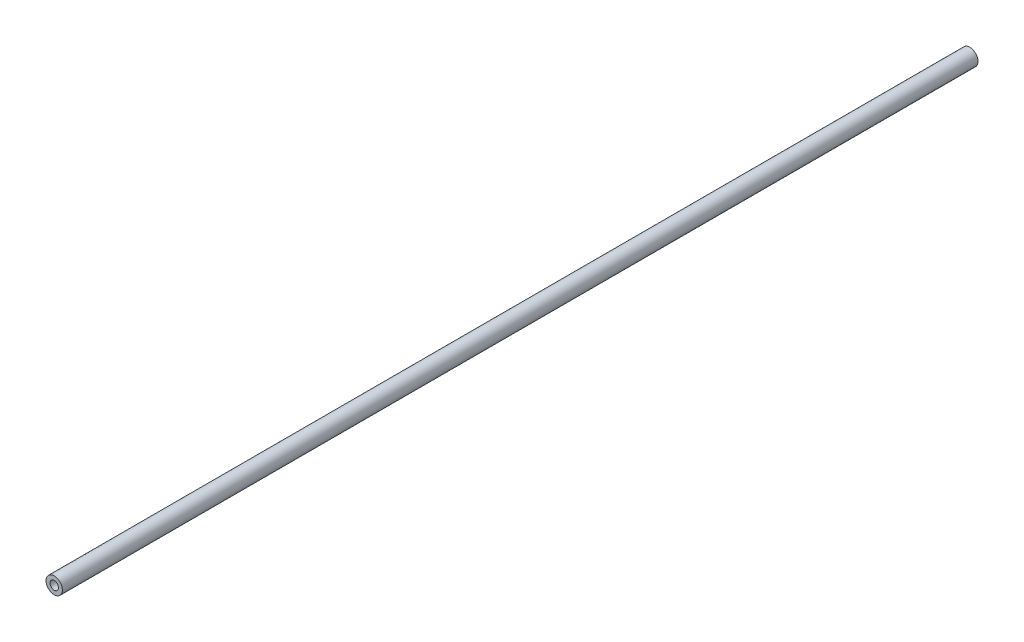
ISO-10303-21;
HEADER;
FILE_DESCRIPTION(('STEP AP214'),'2;1');
FILE_NAME('part.step','',(''),(''),'','','');
FILE_SCHEMA(('AUTOMOTIVE_DESIGN { 1 0 10303 214 1 1 1 1 }'));
ENDSEC;
DATA;
#1=APPLICATION_CONTEXT('core data for automotive mechanical design processes');
#2=APPLICATION_PROTOCOL_DEFINITION('international standard','automotive_design',2000,#1);
#3=PRODUCT_CONTEXT('',#1,'mechanical');
#4=PRODUCT('Part','Part','',(#3));
#5=PRODUCT_RELATED_PRODUCT_CATEGORY('part','',(#4));
#6=PRODUCT_DEFINITION_FORMATION('','',#4);
#7=PRODUCT_DEFINITION_CONTEXT('part definition',#1,'design');
#8=PRODUCT_DEFINITION('design','',#6,#7);
#9=PRODUCT_DEFINITION_SHAPE('','',#8);
#10=(LENGTH_UNIT() NAMED_UNIT(*) SI_UNIT(.MILLI.,.METRE.));
#11=(NAMED_UNIT(*) PLANE_ANGLE_UNIT() SI_UNIT($,.RADIAN.));
#12=(NAMED_UNIT(*) SI_UNIT($,.STERADIAN.) SOLID_ANGLE_UNIT());
#13=UNCERTAINTY_MEASURE_WITH_UNIT(LENGTH_MEASURE(1.E-05),#10,'distance_accuracy_value','');
#14=(GEOMETRIC_REPRESENTATION_CONTEXT(3) GLOBAL_UNCERTAINTY_ASSIGNED_CONTEXT((#13)) GLOBAL_UNIT_ASSIGNED_CONTEXT((#10,
#11,#12)) REPRESENTATION_CONTEXT('',''));
#15=CARTESIAN_POINT('',(0.,0.,0.));
#16=DIRECTION('',(0.,0.,1.));
#17=DIRECTION('',(1.,0.,0.));
#18=AXIS2_PLACEMENT_3D('',#15,#16,#17);
#19=CARTESIAN_POINT('',(0.,0.,559.));
#20=DIRECTION('',(0.,0.,-1.));
#21=DIRECTION('',(-1.,0.,0.));
#22=AXIS2_PLACEMENT_3D('',#19,#20,#21);
#23=CYLINDRICAL_SURFACE('',#22,5.);
#24=CARTESIAN_POINT('',(0.,0.,559.));
#25=DIRECTION('',(0.,0.,1.));
#26=DIRECTION('',(1.,0.,0.));
#27=AXIS2_PLACEMENT_3D('',#24,#25,#26);
#28=CIRCLE('',#27,5.);
#29=CARTESIAN_POINT('',(-5.,0.,559.));
#30=VERTEX_POINT('',#29);
#31=EDGE_CURVE('E11',#30,#30,#28,.T.);
#32=CARTESIAN_POINT('',(0.,0.,0.));
#33=DIRECTION('',(0.,0.,1.));
#34=DIRECTION('',(1.,0.,0.));
#35=AXIS2_PLACEMENT_3D('',#32,#33,#34);
#36=CIRCLE('',#35,5.);
#37=CARTESIAN_POINT('',(-5.,0.,0.));
#38=VERTEX_POINT('',#37);
#39=EDGE_CURVE('E39',#38,#38,#36,.T.);
#40=CARTESIAN_POINT('',(-5.,0.,559.));
#41=CARTESIAN_POINT('',(-5.,0.,553.177083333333));
#42=CARTESIAN_POINT('',(-5.,0.,547.354166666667));
#43=CARTESIAN_POINT('',(-5.,0.,535.708333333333));
#44=CARTESIAN_POINT('',(-5.,0.,529.885416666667));
#45=CARTESIAN_POINT('',(-5.,0.,518.239583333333));
#46=CARTESIAN_POINT('',(-5.,0.,512.416666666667));
#47=CARTESIAN_POINT('',(-5.,0.,500.770833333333));
#48=CARTESIAN_POINT('',(-5.,0.,494.947916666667));
#49=CARTESIAN_POINT('',(-5.,0.,483.302083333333));
#50=CARTESIAN_POINT('',(-5.,0.,477.479166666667));
#51=CARTESIAN_POINT('',(-5.,0.,465.833333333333));
#52=CARTESIAN_POINT('',(-5.,0.,460.010416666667));
#53=CARTESIAN_POINT('',(-5.,0.,448.364583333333));
#54=CARTESIAN_POINT('',(-5.,0.,442.541666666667));
#55=CARTESIAN_POINT('',(-5.,0.,430.895833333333));
#56=CARTESIAN_POINT('',(-5.,0.,425.072916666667));
#57=CARTESIAN_POINT('',(-5.,0.,413.427083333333));
#58=CARTESIAN_POINT('',(-5.,0.,407.604166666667));
#59=CARTESIAN_POINT('',(-5.,0.,395.958333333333));
#60=CARTESIAN_POINT('',(-5.,0.,390.135416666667));
#61=CARTESIAN_POINT('',(-5.,0.,378.489583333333));
#62=CARTESIAN_POINT('',(-5.,0.,372.666666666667));
#63=CARTESIAN_POINT('',(-5.,0.,361.020833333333));
#64=CARTESIAN_POINT('',(-5.,0.,355.197916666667));
#65=CARTESIAN_POINT('',(-5.,0.,343.552083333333));
#66=CARTESIAN_POINT('',(-5.,0.,337.729166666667));
#67=CARTESIAN_POINT('',(-5.,0.,326.083333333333));
#68=CARTESIAN_POINT('',(-5.,0.,320.260416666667));
#69=CARTESIAN_POINT('',(-5.,0.,308.614583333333));
#70=CARTESIAN_POINT('',(-5.,0.,302.791666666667));
#71=CARTESIAN_POINT('',(-5.,0.,291.145833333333));
#72=CARTESIAN_POINT('',(-5.,0.,285.322916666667));
#73=CARTESIAN_POINT('',(-5.,0.,273.677083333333));
#74=CARTESIAN_POINT('',(-5.,0.,267.854166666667));
#75=CARTESIAN_POINT('',(-5.,0.,256.208333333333));
#76=CARTESIAN_POINT('',(-5.,0.,250.385416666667));
#77=CARTESIAN_POINT('',(-5.,0.,238.739583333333));
#78=CARTESIAN_POINT('',(-5.,0.,232.916666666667));
#79=CARTESIAN_POINT('',(-5.,0.,221.270833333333));
#80=CARTESIAN_POINT('',(-5.,0.,215.447916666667));
#81=CARTESIAN_POINT('',(-5.,0.,203.802083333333));
#82=CARTESIAN_POINT('',(-5.,0.,197.979166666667));
#83=CARTESIAN_POINT('',(-5.,0.,186.333333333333));
#84=CARTESIAN_POINT('',(-5.,0.,180.510416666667));
#85=CARTESIAN_POINT('',(-5.,0.,168.864583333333));
#86=CARTESIAN_POINT('',(-5.,0.,163.041666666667));
#87=CARTESIAN_POINT('',(-5.,0.,151.395833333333));
#88=CARTESIAN_POINT('',(-5.,0.,145.572916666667));
#89=CARTESIAN_POINT('',(-5.,0.,133.927083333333));
#90=CARTESIAN_POINT('',(-5.,0.,128.104166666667));
#91=CARTESIAN_POINT('',(-5.,0.,116.458333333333));
#92=CARTESIAN_POINT('',(-5.,0.,110.635416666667));
#93=CARTESIAN_POINT('',(-5.,0.,98.9895833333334));
#94=CARTESIAN_POINT('',(-5.,0.,93.1666666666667));
#95=CARTESIAN_POINT('',(-5.,0.,81.5208333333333));
#96=CARTESIAN_POINT('',(-5.,0.,75.6979166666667));
#97=CARTESIAN_POINT('',(-5.,0.,64.0520833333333));
#98=CARTESIAN_POINT('',(-5.,0.,58.2291666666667));
#99=CARTESIAN_POINT('',(-5.,0.,46.5833333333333));
#100=CARTESIAN_POINT('',(-5.,0.,40.7604166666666));
#101=CARTESIAN_POINT('',(-5.,0.,29.1145833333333));
#102=CARTESIAN_POINT('',(-5.,0.,23.2916666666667));
#103=CARTESIAN_POINT('',(-5.,0.,11.6458333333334));
#104=CARTESIAN_POINT('',(-5.,0.,5.82291666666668));
#105=CARTESIAN_POINT('',(-5.,0.,0.));
#106=B_SPLINE_CURVE_WITH_KNOTS('',3,(#40,#41,#42,#43,#44,#45,#46,#47,#48,#49,#50,#51,#52,#53,
#54,#55,#56,#57,#58,#59,#60,#61,#62,#63,#64,#65,#66,#67,#68,#69,#70,#71,#72,#73,#74,#75,#76,#77,
#78,#79,#80,#81,#82,#83,#84,#85,#86,#87,#88,#89,#90,#91,#92,#93,#94,#95,#96,#97,#98,#99,#100,
#101,#102,#103,#104,#105),.UNSPECIFIED.,.F.,.F.,(4,2,2,2,2,2,2,2,2,2,2,2,2,2,2,2,2,2,2,2,2,2,2,
2,2,2,2,2,2,2,2,2,4),(0.,17.4687499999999,34.9375,52.40625,69.8749999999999,87.3437499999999,
104.8125,122.28125,139.75,157.21875,174.6875,192.15625,209.625,227.09375,244.5625,262.03125,
279.5,296.96875,314.4375,331.90625,349.375,366.84375,384.3125,401.78125,419.25,436.71875,
454.1875,471.65625,489.125,506.59375,524.0625,541.53125,559.),.UNSPECIFIED.);
#107=EDGE_CURVE('BSEAM36',#30,#38,#106,.T.);
#108=ORIENTED_EDGE('',*,*,#31,.F.);
#109=ORIENTED_EDGE('',*,*,#39,.T.);
#110=ORIENTED_EDGE('',*,*,#107,.T.);
#111=ORIENTED_EDGE('',*,*,#107,.F.);
#112=EDGE_LOOP('',(#108,#110,#109,#111));
#113=FACE_BOUND('',#112,.T.);
#114=ADVANCED_FACE('F36',(#113),#23,.T.);
#115=CARTESIAN_POINT('',(0.,0.,559.));
#116=DIRECTION('',(0.,0.,1.));
#117=DIRECTION('',(1.,0.,0.));
#118=AXIS2_PLACEMENT_3D('',#115,#116,#117);
#119=PLANE('',#118);
#120=CARTESIAN_POINT('',(0.,0.,559.));
#121=DIRECTION('',(0.,0.,1.));
#122=DIRECTION('',(1.,0.,0.));
#123=AXIS2_PLACEMENT_3D('',#120,#121,#122);
#124=CIRCLE('',#123,2.59079999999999);
#125=CARTESIAN_POINT('',(2.59079999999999,0.,559.));
#126=VERTEX_POINT('',#125);
#127=EDGE_CURVE('E60',#126,#126,#124,.T.);
#128=ORIENTED_EDGE('',*,*,#127,.F.);
#129=EDGE_LOOP('',(#128));
#130=FACE_BOUND('',#129,.T.);
#131=ORIENTED_EDGE('',*,*,#31,.T.);
#132=EDGE_LOOP('',(#131));
#133=FACE_BOUND('',#132,.T.);
#134=ADVANCED_FACE('F78',(#130,#133),#119,.T.);
#135=CARTESIAN_POINT('',(0.,0.,0.));
#136=DIRECTION('',(0.,0.,1.));
#137=DIRECTION('',(1.,0.,0.));
#138=AXIS2_PLACEMENT_3D('',#135,#136,#137);
#139=PLANE('',#138);
#140=CARTESIAN_POINT('',(0.,0.,0.));
#141=DIRECTION('',(0.,0.,-1.));
#142=DIRECTION('',(-1.,0.,0.));
#143=AXIS2_PLACEMENT_3D('',#140,#141,#142);
#144=CIRCLE('',#143,2.59079999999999);
#145=CARTESIAN_POINT('',(-2.59079999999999,0.,0.));
#146=VERTEX_POINT('',#145);
#147=EDGE_CURVE('E59',#146,#146,#144,.T.);
#148=ORIENTED_EDGE('',*,*,#147,.F.);
#149=EDGE_LOOP('',(#148));
#150=FACE_BOUND('',#149,.T.);
#151=ORIENTED_EDGE('',*,*,#39,.F.);
#152=EDGE_LOOP('',(#151));
#153=FACE_BOUND('',#152,.T.);
#154=ADVANCED_FACE('F75',(#150,#153),#139,.F.);
#155=CARTESIAN_POINT('',(0.,0.,30.));
#156=DIRECTION('',(0.,0.,-1.));
#157=DIRECTION('',(-1.,0.,0.));
#158=AXIS2_PLACEMENT_3D('',#155,#156,#157);
#159=CONICAL_SURFACE('',#158,2.59079999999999,1.02974425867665);
#160=CARTESIAN_POINT('',(0.,0.,31.5567096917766));
#161=VERTEX_POINT('',#160);
#162=VERTEX_LOOP('',#161);
#163=FACE_BOUND('',#162,.T.);
#164=CARTESIAN_POINT('',(0.,0.,30.));
#165=DIRECTION('',(0.,0.,-1.));
#166=DIRECTION('',(-1.,0.,0.));
#167=AXIS2_PLACEMENT_3D('',#164,#165,#166);
#168=CIRCLE('',#167,2.59079999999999);
#169=CARTESIAN_POINT('',(-2.59079999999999,0.,30.));
#170=VERTEX_POINT('',#169);
#171=EDGE_CURVE('E63',#170,#170,#168,.T.);
#172=ORIENTED_EDGE('',*,*,#171,.T.);
#173=EDGE_LOOP('',(#172));
#174=FACE_BOUND('',#173,.T.);
#175=ADVANCED_FACE('F77',(#163,#174),#159,.F.);
#176=CARTESIAN_POINT('',(0.,0.,0.));
#177=DIRECTION('',(0.,0.,-1.));
#178=DIRECTION('',(-1.,0.,0.));
#179=AXIS2_PLACEMENT_3D('',#176,#177,#178);
#180=CYLINDRICAL_SURFACE('',#179,2.59079999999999);
#181=ORIENTED_EDGE('',*,*,#171,.F.);
#182=EDGE_LOOP('',(#181));
#183=FACE_BOUND('',#182,.T.);
#184=ORIENTED_EDGE('',*,*,#147,.T.);
#185=EDGE_LOOP('',(#184));
#186=FACE_BOUND('',#185,.T.);
#187=ADVANCED_FACE('F53',(#183,#186),#180,.F.);
#188=CARTESIAN_POINT('',(0.,0.,529.));
#189=DIRECTION('',(0.,0.,1.));
#190=DIRECTION('',(1.,0.,0.));
#191=AXIS2_PLACEMENT_3D('',#188,#189,#190);
#192=CONICAL_SURFACE('',#191,2.59079999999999,1.02974425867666);
#193=CARTESIAN_POINT('',(0.,0.,527.443290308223));
#194=VERTEX_POINT('',#193);
#195=VERTEX_LOOP('',#194);
#196=FACE_BOUND('',#195,.T.);
#197=CARTESIAN_POINT('',(0.,0.,529.));
#198=DIRECTION('',(0.,0.,1.));
#199=DIRECTION('',(1.,0.,0.));
#200=AXIS2_PLACEMENT_3D('',#197,#198,#199);
#201=CIRCLE('',#200,2.59079999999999);
#202=CARTESIAN_POINT('',(2.59079999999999,0.,529.));
#203=VERTEX_POINT('',#202);
#204=EDGE_CURVE('E57',#203,#203,#201,.T.);
#205=ORIENTED_EDGE('',*,*,#204,.T.);
#206=EDGE_LOOP('',(#205));
#207=FACE_BOUND('',#206,.T.);
#208=ADVANCED_FACE('F49',(#196,#207),#192,.F.);
#209=CARTESIAN_POINT('',(0.,0.,559.));
#210=DIRECTION('',(0.,0.,1.));
#211=DIRECTION('',(1.,0.,0.));
#212=AXIS2_PLACEMENT_3D('',#209,#210,#211);
#213=CYLINDRICAL_SURFACE('',#212,2.59079999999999);
#214=ORIENTED_EDGE('',*,*,#204,.F.);
#215=EDGE_LOOP('',(#214));
#216=FACE_BOUND('',#215,.T.);
#217=ORIENTED_EDGE('',*,*,#127,.T.);
#218=EDGE_LOOP('',(#217));
#219=FACE_BOUND('',#218,.T.);
#220=ADVANCED_FACE('F52',(#216,#219),#213,.F.);
#221=CLOSED_SHELL('',(#114,#134,#154,#175,#187,#208,#220));
#222=MANIFOLD_SOLID_BREP('B2',#221);
#223=ADVANCED_BREP_SHAPE_REPRESENTATION('',(#18,#222),#14);
#224=SHAPE_DEFINITION_REPRESENTATION(#9,#223);
ENDSEC;
END-ISO-10303-21;
